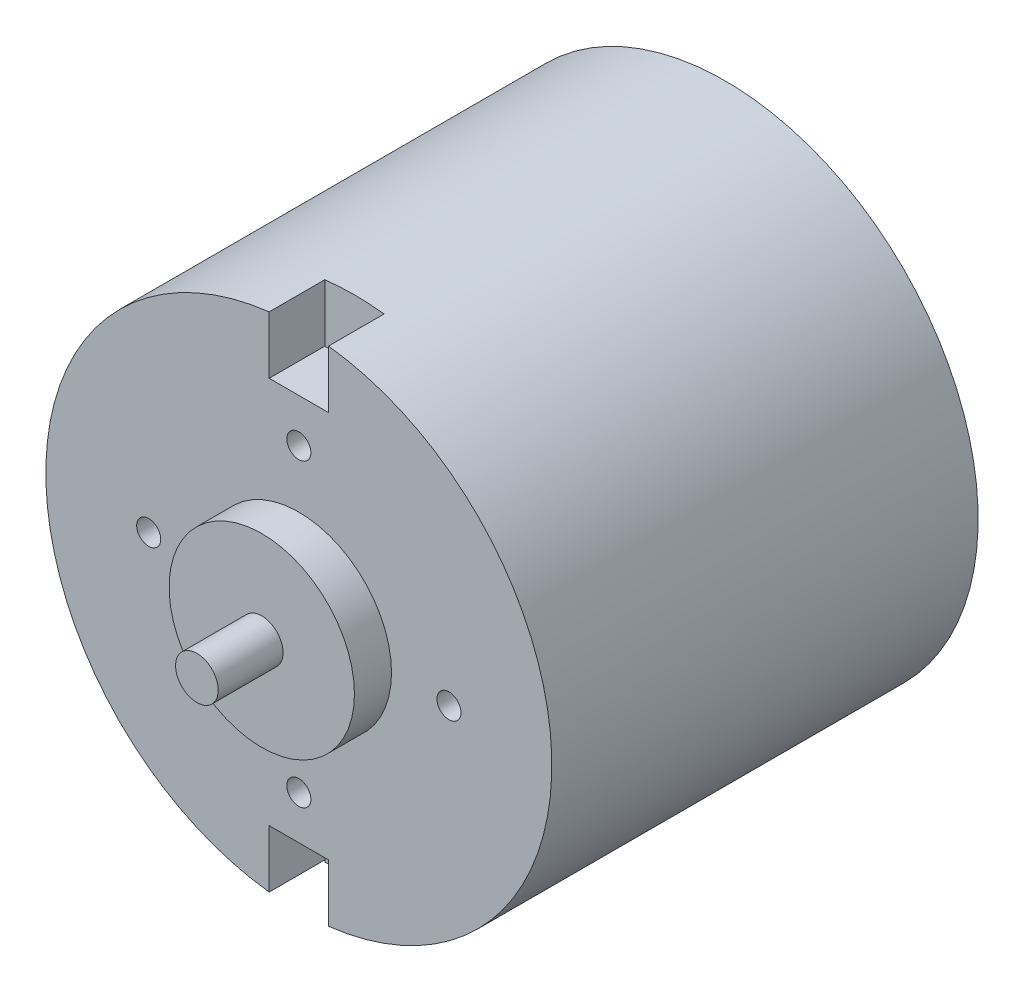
ISO-10303-21;
HEADER;
FILE_DESCRIPTION(('STEP AP214'),'2;1');
FILE_NAME('part.step','',(''),(''),'','','');
FILE_SCHEMA(('AUTOMOTIVE_DESIGN { 1 0 10303 214 1 1 1 1 }'));
ENDSEC;
DATA;
#1=APPLICATION_CONTEXT('core data for automotive mechanical design processes');
#2=APPLICATION_PROTOCOL_DEFINITION('international standard','automotive_design',2000,#1);
#3=PRODUCT_CONTEXT('',#1,'mechanical');
#4=PRODUCT('Part','Part','',(#3));
#5=PRODUCT_RELATED_PRODUCT_CATEGORY('part','',(#4));
#6=PRODUCT_DEFINITION_FORMATION('','',#4);
#7=PRODUCT_DEFINITION_CONTEXT('part definition',#1,'design');
#8=PRODUCT_DEFINITION('design','',#6,#7);
#9=PRODUCT_DEFINITION_SHAPE('','',#8);
#10=(LENGTH_UNIT() NAMED_UNIT(*) SI_UNIT(.MILLI.,.METRE.));
#11=(NAMED_UNIT(*) PLANE_ANGLE_UNIT() SI_UNIT($,.RADIAN.));
#12=(NAMED_UNIT(*) SI_UNIT($,.STERADIAN.) SOLID_ANGLE_UNIT());
#13=UNCERTAINTY_MEASURE_WITH_UNIT(LENGTH_MEASURE(1.E-05),#10,'distance_accuracy_value','');
#14=(GEOMETRIC_REPRESENTATION_CONTEXT(3) GLOBAL_UNCERTAINTY_ASSIGNED_CONTEXT((#13)) GLOBAL_UNIT_ASSIGNED_CONTEXT((#10,
#11,#12)) REPRESENTATION_CONTEXT('',''));
#15=CARTESIAN_POINT('',(0.,0.,0.));
#16=DIRECTION('',(0.,0.,1.));
#17=DIRECTION('',(1.,0.,0.));
#18=AXIS2_PLACEMENT_3D('',#15,#16,#17);
#19=CARTESIAN_POINT('',(-1.6,0.,3.));
#20=DIRECTION('',(1.,0.,0.));
#21=DIRECTION('',(0.,1.,0.));
#22=AXIS2_PLACEMENT_3D('',#19,#20,#21);
#23=PLANE('',#22);
#24=DIRECTION('',(0.,-1.,0.));
#25=VECTOR('',#24,1.);
#26=CARTESIAN_POINT('',(-1.6,0.,0.));
#27=LINE('',#26,#25);
#28=CARTESIAN_POINT('',(-1.6,13.5559027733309,0.));
#29=VERTEX_POINT('',#28);
#30=CARTESIAN_POINT('',(-1.6,10.45,0.));
#31=VERTEX_POINT('',#30);
#32=EDGE_CURVE('E293',#29,#31,#27,.T.);
#33=ORIENTED_EDGE('',*,*,#32,.F.);
#34=DIRECTION('',(0.,0.,-1.));
#35=VECTOR('',#34,1.);
#36=CARTESIAN_POINT('',(-1.6,13.5559027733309,3.));
#37=LINE('',#36,#35);
#38=CARTESIAN_POINT('',(-1.6,13.5559027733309,3.));
#39=VERTEX_POINT('',#38);
#40=EDGE_CURVE('E12',#39,#29,#37,.T.);
#41=ORIENTED_EDGE('',*,*,#40,.F.);
#42=DIRECTION('',(0.,-1.,0.));
#43=VECTOR('',#42,1.);
#44=CARTESIAN_POINT('',(-1.6,0.,3.));
#45=LINE('',#44,#43);
#46=CARTESIAN_POINT('',(-1.6,10.45,3.));
#47=VERTEX_POINT('',#46);
#48=EDGE_CURVE('E253',#39,#47,#45,.T.);
#49=ORIENTED_EDGE('',*,*,#48,.T.);
#50=DIRECTION('',(0.,0.,-1.));
#51=VECTOR('',#50,1.);
#52=CARTESIAN_POINT('',(-1.6,10.45,3.));
#53=LINE('',#52,#51);
#54=EDGE_CURVE('E111',#47,#31,#53,.T.);
#55=ORIENTED_EDGE('',*,*,#54,.T.);
#56=EDGE_LOOP('',(#33,#41,#49,#55));
#57=FACE_BOUND('',#56,.T.);
#58=ADVANCED_FACE('F93',(#57),#23,.T.);
#59=CARTESIAN_POINT('',(-1.6,0.,3.));
#60=DIRECTION('',(-1.,0.,0.));
#61=DIRECTION('',(0.,-1.,0.));
#62=AXIS2_PLACEMENT_3D('',#59,#60,#61);
#63=PLANE('',#62);
#64=DIRECTION('',(0.,1.,0.));
#65=VECTOR('',#64,1.);
#66=CARTESIAN_POINT('',(-1.6,0.,0.));
#67=LINE('',#66,#65);
#68=CARTESIAN_POINT('',(-1.6,-13.5559027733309,0.));
#69=VERTEX_POINT('',#68);
#70=CARTESIAN_POINT('',(-1.6,-10.45,0.));
#71=VERTEX_POINT('',#70);
#72=EDGE_CURVE('E296',#69,#71,#67,.T.);
#73=ORIENTED_EDGE('',*,*,#72,.T.);
#74=DIRECTION('',(0.,0.,-1.));
#75=VECTOR('',#74,1.);
#76=CARTESIAN_POINT('',(-1.6,-10.45,3.));
#77=LINE('',#76,#75);
#78=CARTESIAN_POINT('',(-1.6,-10.45,3.));
#79=VERTEX_POINT('',#78);
#80=EDGE_CURVE('E329',#79,#71,#77,.T.);
#81=ORIENTED_EDGE('',*,*,#80,.F.);
#82=DIRECTION('',(0.,1.,0.));
#83=VECTOR('',#82,1.);
#84=CARTESIAN_POINT('',(-1.6,0.,3.));
#85=LINE('',#84,#83);
#86=CARTESIAN_POINT('',(-1.6,-13.5559027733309,3.));
#87=VERTEX_POINT('',#86);
#88=EDGE_CURVE('E260',#87,#79,#85,.T.);
#89=ORIENTED_EDGE('',*,*,#88,.F.);
#90=DIRECTION('',(0.,0.,-1.));
#91=VECTOR('',#90,1.);
#92=CARTESIAN_POINT('',(-1.6,-13.5559027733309,3.));
#93=LINE('',#92,#91);
#94=EDGE_CURVE('E104',#87,#69,#93,.T.);
#95=ORIENTED_EDGE('',*,*,#94,.T.);
#96=EDGE_LOOP('',(#73,#81,#89,#95));
#97=FACE_BOUND('',#96,.T.);
#98=ADVANCED_FACE('F337',(#97),#63,.F.);
#99=CARTESIAN_POINT('',(0.,-10.45,3.));
#100=DIRECTION('',(0.,1.,0.));
#101=DIRECTION('',(-1.,0.,0.));
#102=AXIS2_PLACEMENT_3D('',#99,#100,#101);
#103=PLANE('',#102);
#104=DIRECTION('',(1.,0.,0.));
#105=VECTOR('',#104,1.);
#106=CARTESIAN_POINT('',(0.,-10.45,0.));
#107=LINE('',#106,#105);
#108=CARTESIAN_POINT('',(1.6,-10.45,0.));
#109=VERTEX_POINT('',#108);
#110=EDGE_CURVE('E300',#71,#109,#107,.T.);
#111=ORIENTED_EDGE('',*,*,#110,.T.);
#112=DIRECTION('',(0.,0.,-1.));
#113=VECTOR('',#112,1.);
#114=CARTESIAN_POINT('',(1.6,-10.45,3.));
#115=LINE('',#114,#113);
#116=CARTESIAN_POINT('',(1.6,-10.45,3.));
#117=VERTEX_POINT('',#116);
#118=EDGE_CURVE('E325',#117,#109,#115,.T.);
#119=ORIENTED_EDGE('',*,*,#118,.F.);
#120=DIRECTION('',(1.,0.,0.));
#121=VECTOR('',#120,1.);
#122=CARTESIAN_POINT('',(0.,-10.45,3.));
#123=LINE('',#122,#121);
#124=EDGE_CURVE('E265',#79,#117,#123,.T.);
#125=ORIENTED_EDGE('',*,*,#124,.F.);
#126=ORIENTED_EDGE('',*,*,#80,.T.);
#127=EDGE_LOOP('',(#111,#119,#125,#126));
#128=FACE_BOUND('',#127,.T.);
#129=ADVANCED_FACE('F355',(#128),#103,.F.);
#130=CARTESIAN_POINT('',(1.6,0.,3.));
#131=DIRECTION('',(-1.,0.,0.));
#132=DIRECTION('',(0.,-1.,0.));
#133=AXIS2_PLACEMENT_3D('',#130,#131,#132);
#134=PLANE('',#133);
#135=DIRECTION('',(0.,1.,0.));
#136=VECTOR('',#135,1.);
#137=CARTESIAN_POINT('',(1.6,0.,0.));
#138=LINE('',#137,#136);
#139=CARTESIAN_POINT('',(1.6,-13.5559027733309,0.));
#140=VERTEX_POINT('',#139);
#141=EDGE_CURVE('E304',#140,#109,#138,.T.);
#142=ORIENTED_EDGE('',*,*,#141,.F.);
#143=DIRECTION('',(0.,0.,-1.));
#144=VECTOR('',#143,1.);
#145=CARTESIAN_POINT('',(1.6,-13.5559027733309,3.));
#146=LINE('',#145,#144);
#147=CARTESIAN_POINT('',(1.6,-13.5559027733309,3.));
#148=VERTEX_POINT('',#147);
#149=EDGE_CURVE('E182',#148,#140,#146,.T.);
#150=ORIENTED_EDGE('',*,*,#149,.F.);
#151=DIRECTION('',(0.,1.,0.));
#152=VECTOR('',#151,1.);
#153=CARTESIAN_POINT('',(1.6,0.,3.));
#154=LINE('',#153,#152);
#155=EDGE_CURVE('E268',#148,#117,#154,.T.);
#156=ORIENTED_EDGE('',*,*,#155,.T.);
#157=ORIENTED_EDGE('',*,*,#118,.T.);
#158=EDGE_LOOP('',(#142,#150,#156,#157));
#159=FACE_BOUND('',#158,.T.);
#160=ADVANCED_FACE('F352',(#159),#134,.T.);
#161=CARTESIAN_POINT('',(0.,0.,3.));
#162=DIRECTION('',(0.,0.,-1.));
#163=DIRECTION('',(-1.,0.,0.));
#164=AXIS2_PLACEMENT_3D('',#161,#162,#163);
#165=CYLINDRICAL_SURFACE('',#164,13.65);
#166=ORIENTED_EDGE('',*,*,#149,.T.);
#167=DIRECTION('',(0.,0.,1.));
#168=VECTOR('',#167,1.);
#169=CARTESIAN_POINT('',(1.6,-13.5559027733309,-20.));
#170=LINE('',#169,#168);
#171=CARTESIAN_POINT('',(1.6,-13.5559027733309,-20.));
#172=VERTEX_POINT('',#171);
#173=EDGE_CURVE('E175',#172,#140,#170,.T.);
#174=ORIENTED_EDGE('',*,*,#173,.F.);
#175=CARTESIAN_POINT('',(0.,0.,-20.));
#176=DIRECTION('',(0.,0.,1.));
#177=DIRECTION('',(1.,0.,0.));
#178=AXIS2_PLACEMENT_3D('',#175,#176,#177);
#179=CIRCLE('',#178,13.65);
#180=CARTESIAN_POINT('',(-1.6,-13.5559027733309,-20.));
#181=VERTEX_POINT('',#180);
#182=EDGE_CURVE('E180',#172,#181,#179,.T.);
#183=ORIENTED_EDGE('',*,*,#182,.T.);
#184=DIRECTION('',(0.,0.,1.));
#185=VECTOR('',#184,1.);
#186=CARTESIAN_POINT('',(-1.6,-13.5559027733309,-20.));
#187=LINE('',#186,#185);
#188=EDGE_CURVE('E188',#181,#69,#187,.T.);
#189=ORIENTED_EDGE('',*,*,#188,.T.);
#190=ORIENTED_EDGE('',*,*,#94,.F.);
#191=CARTESIAN_POINT('',(0.,0.,3.));
#192=DIRECTION('',(0.,0.,1.));
#193=DIRECTION('',(1.,0.,0.));
#194=AXIS2_PLACEMENT_3D('',#191,#192,#193);
#195=CIRCLE('',#194,13.65);
#196=EDGE_CURVE('E256',#39,#87,#195,.T.);
#197=ORIENTED_EDGE('',*,*,#196,.F.);
#198=ORIENTED_EDGE('',*,*,#40,.T.);
#199=CARTESIAN_POINT('',(0.,0.,0.));
#200=DIRECTION('',(0.,0.,1.));
#201=DIRECTION('',(1.,0.,0.));
#202=AXIS2_PLACEMENT_3D('',#199,#200,#201);
#203=CIRCLE('',#202,13.65);
#204=CARTESIAN_POINT('',(1.6,13.5559027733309,0.));
#205=VERTEX_POINT('',#204);
#206=EDGE_CURVE('E205',#205,#29,#203,.T.);
#207=ORIENTED_EDGE('',*,*,#206,.F.);
#208=DIRECTION('',(0.,0.,-1.));
#209=VECTOR('',#208,1.);
#210=CARTESIAN_POINT('',(1.6,13.5559027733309,3.));
#211=LINE('',#210,#209);
#212=CARTESIAN_POINT('',(1.6,13.5559027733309,3.));
#213=VERTEX_POINT('',#212);
#214=EDGE_CURVE('E319',#213,#205,#211,.T.);
#215=ORIENTED_EDGE('',*,*,#214,.F.);
#216=EDGE_CURVE('E261',#148,#213,#195,.T.);
#217=ORIENTED_EDGE('',*,*,#216,.F.);
#218=EDGE_LOOP('',(#166,#174,#183,#189,#190,#197,#198,#207,#215,#217));
#219=FACE_BOUND('',#218,.T.);
#220=ADVANCED_FACE('F177',(#219),#165,.T.);
#221=CARTESIAN_POINT('',(1.6,0.,3.));
#222=DIRECTION('',(1.,0.,0.));
#223=DIRECTION('',(0.,1.,0.));
#224=AXIS2_PLACEMENT_3D('',#221,#222,#223);
#225=PLANE('',#224);
#226=DIRECTION('',(0.,-1.,0.));
#227=VECTOR('',#226,1.);
#228=CARTESIAN_POINT('',(1.6,0.,0.));
#229=LINE('',#228,#227);
#230=CARTESIAN_POINT('',(1.6,10.45,0.));
#231=VERTEX_POINT('',#230);
#232=EDGE_CURVE('E307',#205,#231,#229,.T.);
#233=ORIENTED_EDGE('',*,*,#232,.T.);
#234=DIRECTION('',(0.,0.,-1.));
#235=VECTOR('',#234,1.);
#236=CARTESIAN_POINT('',(1.6,10.45,3.));
#237=LINE('',#236,#235);
#238=CARTESIAN_POINT('',(1.6,10.45,3.));
#239=VERTEX_POINT('',#238);
#240=EDGE_CURVE('E315',#239,#231,#237,.T.);
#241=ORIENTED_EDGE('',*,*,#240,.F.);
#242=DIRECTION('',(0.,-1.,0.));
#243=VECTOR('',#242,1.);
#244=CARTESIAN_POINT('',(1.6,0.,3.));
#245=LINE('',#244,#243);
#246=EDGE_CURVE('E272',#213,#239,#245,.T.);
#247=ORIENTED_EDGE('',*,*,#246,.F.);
#248=ORIENTED_EDGE('',*,*,#214,.T.);
#249=EDGE_LOOP('',(#233,#241,#247,#248));
#250=FACE_BOUND('',#249,.T.);
#251=ADVANCED_FACE('F365',(#250),#225,.F.);
#252=CARTESIAN_POINT('',(0.,8.1,3.));
#253=DIRECTION('',(0.,0.,-1.));
#254=DIRECTION('',(-1.,0.,0.));
#255=AXIS2_PLACEMENT_3D('',#252,#253,#254);
#256=CYLINDRICAL_SURFACE('',#255,0.65);
#257=CARTESIAN_POINT('',(0.,8.1,3.));
#258=DIRECTION('',(0.,0.,1.));
#259=DIRECTION('',(1.,0.,0.));
#260=AXIS2_PLACEMENT_3D('',#257,#258,#259);
#261=CIRCLE('',#260,0.65);
#262=CARTESIAN_POINT('',(0.65,8.1,3.));
#263=VERTEX_POINT('',#262);
#264=EDGE_CURVE('E249',#263,#263,#261,.T.);
#265=ORIENTED_EDGE('',*,*,#264,.T.);
#266=EDGE_LOOP('',(#265));
#267=FACE_BOUND('',#266,.T.);
#268=CARTESIAN_POINT('',(0.,8.1,0.));
#269=DIRECTION('',(0.,0.,1.));
#270=DIRECTION('',(1.,0.,0.));
#271=AXIS2_PLACEMENT_3D('',#268,#269,#270);
#272=CIRCLE('',#271,0.65);
#273=CARTESIAN_POINT('',(0.65,8.1,0.));
#274=VERTEX_POINT('',#273);
#275=EDGE_CURVE('E289',#274,#274,#272,.T.);
#276=ORIENTED_EDGE('',*,*,#275,.F.);
#277=EDGE_LOOP('',(#276));
#278=FACE_BOUND('',#277,.T.);
#279=ADVANCED_FACE('F389',(#267,#278),#256,.F.);
#280=CARTESIAN_POINT('',(0.,-8.1,3.));
#281=DIRECTION('',(0.,0.,-1.));
#282=DIRECTION('',(-1.,0.,0.));
#283=AXIS2_PLACEMENT_3D('',#280,#281,#282);
#284=CYLINDRICAL_SURFACE('',#283,0.65);
#285=CARTESIAN_POINT('',(0.,-8.1,3.));
#286=DIRECTION('',(0.,0.,1.));
#287=DIRECTION('',(1.,0.,0.));
#288=AXIS2_PLACEMENT_3D('',#285,#286,#287);
#289=CIRCLE('',#288,0.65);
#290=CARTESIAN_POINT('',(0.65,-8.1,3.));
#291=VERTEX_POINT('',#290);
#292=EDGE_CURVE('E245',#291,#291,#289,.T.);
#293=ORIENTED_EDGE('',*,*,#292,.T.);
#294=EDGE_LOOP('',(#293));
#295=FACE_BOUND('',#294,.T.);
#296=CARTESIAN_POINT('',(0.,-8.1,0.));
#297=DIRECTION('',(0.,0.,1.));
#298=DIRECTION('',(1.,0.,0.));
#299=AXIS2_PLACEMENT_3D('',#296,#297,#298);
#300=CIRCLE('',#299,0.65);
#301=CARTESIAN_POINT('',(0.65,-8.1,0.));
#302=VERTEX_POINT('',#301);
#303=EDGE_CURVE('E285',#302,#302,#300,.T.);
#304=ORIENTED_EDGE('',*,*,#303,.F.);
#305=EDGE_LOOP('',(#304));
#306=FACE_BOUND('',#305,.T.);
#307=ADVANCED_FACE('F392',(#295,#306),#284,.F.);
#308=CARTESIAN_POINT('',(-8.1,0.,3.));
#309=DIRECTION('',(0.,0.,-1.));
#310=DIRECTION('',(-1.,0.,0.));
#311=AXIS2_PLACEMENT_3D('',#308,#309,#310);
#312=CYLINDRICAL_SURFACE('',#311,0.65);
#313=CARTESIAN_POINT('',(-8.1,0.,3.));
#314=DIRECTION('',(0.,0.,1.));
#315=DIRECTION('',(1.,0.,0.));
#316=AXIS2_PLACEMENT_3D('',#313,#314,#315);
#317=CIRCLE('',#316,0.65);
#318=CARTESIAN_POINT('',(-7.45,0.,3.));
#319=VERTEX_POINT('',#318);
#320=EDGE_CURVE('E240',#319,#319,#317,.T.);
#321=ORIENTED_EDGE('',*,*,#320,.T.);
#322=EDGE_LOOP('',(#321));
#323=FACE_BOUND('',#322,.T.);
#324=CARTESIAN_POINT('',(-8.1,0.,0.));
#325=DIRECTION('',(0.,0.,1.));
#326=DIRECTION('',(1.,0.,0.));
#327=AXIS2_PLACEMENT_3D('',#324,#325,#326);
#328=CIRCLE('',#327,0.65);
#329=CARTESIAN_POINT('',(-7.45,0.,0.));
#330=VERTEX_POINT('',#329);
#331=EDGE_CURVE('E281',#330,#330,#328,.T.);
#332=ORIENTED_EDGE('',*,*,#331,.F.);
#333=EDGE_LOOP('',(#332));
#334=FACE_BOUND('',#333,.T.);
#335=ADVANCED_FACE('F378',(#323,#334),#312,.F.);
#336=CARTESIAN_POINT('',(8.1,0.,3.));
#337=DIRECTION('',(0.,0.,-1.));
#338=DIRECTION('',(-1.,0.,0.));
#339=AXIS2_PLACEMENT_3D('',#336,#337,#338);
#340=CYLINDRICAL_SURFACE('',#339,0.649999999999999);
#341=CARTESIAN_POINT('',(8.1,0.,3.));
#342=DIRECTION('',(0.,0.,1.));
#343=DIRECTION('',(1.,0.,0.));
#344=AXIS2_PLACEMENT_3D('',#341,#342,#343);
#345=CIRCLE('',#344,0.649999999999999);
#346=CARTESIAN_POINT('',(8.75,0.,3.));
#347=VERTEX_POINT('',#346);
#348=EDGE_CURVE('E236',#347,#347,#345,.T.);
#349=ORIENTED_EDGE('',*,*,#348,.T.);
#350=EDGE_LOOP('',(#349));
#351=FACE_BOUND('',#350,.T.);
#352=CARTESIAN_POINT('',(8.1,0.,0.));
#353=DIRECTION('',(0.,0.,1.));
#354=DIRECTION('',(1.,0.,0.));
#355=AXIS2_PLACEMENT_3D('',#352,#353,#354);
#356=CIRCLE('',#355,0.649999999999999);
#357=CARTESIAN_POINT('',(8.75,0.,0.));
#358=VERTEX_POINT('',#357);
#359=EDGE_CURVE('E215',#358,#358,#356,.T.);
#360=ORIENTED_EDGE('',*,*,#359,.F.);
#361=EDGE_LOOP('',(#360));
#362=FACE_BOUND('',#361,.T.);
#363=ADVANCED_FACE('F95',(#351,#362),#340,.F.);
#364=CARTESIAN_POINT('',(0.,10.45,3.));
#365=DIRECTION('',(0.,1.,0.));
#366=DIRECTION('',(0.,0.,1.));
#367=AXIS2_PLACEMENT_3D('',#364,#365,#366);
#368=PLANE('',#367);
#369=DIRECTION('',(1.,0.,0.));
#370=VECTOR('',#369,1.);
#371=CARTESIAN_POINT('',(0.,10.45,0.));
#372=LINE('',#371,#370);
#373=EDGE_CURVE('E241',#31,#231,#372,.T.);
#374=ORIENTED_EDGE('',*,*,#373,.F.);
#375=ORIENTED_EDGE('',*,*,#54,.F.);
#376=DIRECTION('',(1.,0.,0.));
#377=VECTOR('',#376,1.);
#378=CARTESIAN_POINT('',(0.,10.45,3.));
#379=LINE('',#378,#377);
#380=EDGE_CURVE('E275',#47,#239,#379,.T.);
#381=ORIENTED_EDGE('',*,*,#380,.T.);
#382=ORIENTED_EDGE('',*,*,#240,.T.);
#383=EDGE_LOOP('',(#374,#375,#381,#382));
#384=FACE_BOUND('',#383,.T.);
#385=ADVANCED_FACE('F369',(#384),#368,.T.);
#386=CARTESIAN_POINT('',(0.,0.,3.));
#387=DIRECTION('',(0.,0.,1.));
#388=DIRECTION('',(1.,0.,0.));
#389=AXIS2_PLACEMENT_3D('',#386,#387,#388);
#390=PLANE('',#389);
#391=CARTESIAN_POINT('',(0.,0.,3.));
#392=DIRECTION('',(0.,0.,1.));
#393=DIRECTION('',(1.,0.,0.));
#394=AXIS2_PLACEMENT_3D('',#391,#392,#393);
#395=CIRCLE('',#394,5.);
#396=CARTESIAN_POINT('',(5.,0.,3.));
#397=VERTEX_POINT('',#396);
#398=EDGE_CURVE('E97',#397,#397,#395,.F.);
#399=ORIENTED_EDGE('',*,*,#398,.T.);
#400=EDGE_LOOP('',(#399));
#401=FACE_BOUND('',#400,.T.);
#402=ORIENTED_EDGE('',*,*,#348,.F.);
#403=EDGE_LOOP('',(#402));
#404=FACE_BOUND('',#403,.T.);
#405=ORIENTED_EDGE('',*,*,#320,.F.);
#406=EDGE_LOOP('',(#405));
#407=FACE_BOUND('',#406,.T.);
#408=ORIENTED_EDGE('',*,*,#292,.F.);
#409=EDGE_LOOP('',(#408));
#410=FACE_BOUND('',#409,.T.);
#411=ORIENTED_EDGE('',*,*,#264,.F.);
#412=EDGE_LOOP('',(#411));
#413=FACE_BOUND('',#412,.T.);
#414=ORIENTED_EDGE('',*,*,#48,.F.);
#415=ORIENTED_EDGE('',*,*,#196,.T.);
#416=ORIENTED_EDGE('',*,*,#88,.T.);
#417=ORIENTED_EDGE('',*,*,#124,.T.);
#418=ORIENTED_EDGE('',*,*,#155,.F.);
#419=ORIENTED_EDGE('',*,*,#216,.T.);
#420=ORIENTED_EDGE('',*,*,#246,.T.);
#421=ORIENTED_EDGE('',*,*,#380,.F.);
#422=EDGE_LOOP('',(#414,#415,#416,#417,#418,#419,#420,#421));
#423=FACE_BOUND('',#422,.T.);
#424=ADVANCED_FACE('F357',(#401,#404,#407,#410,#413,#423),#390,.T.);
#425=CARTESIAN_POINT('',(-1.6,-13.65,-20.));
#426=DIRECTION('',(0.,-1.,0.));
#427=DIRECTION('',(0.,0.,-1.));
#428=AXIS2_PLACEMENT_3D('',#425,#426,#427);
#429=PLANE('',#428);
#430=DIRECTION('',(1.,0.,0.));
#431=VECTOR('',#430,1.);
#432=CARTESIAN_POINT('',(-1.6,-13.65,0.));
#433=LINE('',#432,#431);
#434=CARTESIAN_POINT('',(-1.6,-13.65,0.));
#435=VERTEX_POINT('',#434);
#436=CARTESIAN_POINT('',(1.6,-13.65,0.));
#437=VERTEX_POINT('',#436);
#438=EDGE_CURVE('E222',#435,#437,#433,.T.);
#439=ORIENTED_EDGE('',*,*,#438,.F.);
#440=DIRECTION('',(0.,0.,1.));
#441=VECTOR('',#440,1.);
#442=CARTESIAN_POINT('',(-1.6,-13.65,-20.));
#443=LINE('',#442,#441);
#444=CARTESIAN_POINT('',(-1.6,-13.65,-20.));
#445=VERTEX_POINT('',#444);
#446=EDGE_CURVE('E208',#445,#435,#443,.T.);
#447=ORIENTED_EDGE('',*,*,#446,.F.);
#448=DIRECTION('',(1.,0.,0.));
#449=VECTOR('',#448,1.);
#450=CARTESIAN_POINT('',(-1.6,-13.65,-20.));
#451=LINE('',#450,#449);
#452=CARTESIAN_POINT('',(1.6,-13.65,-20.));
#453=VERTEX_POINT('',#452);
#454=EDGE_CURVE('E199',#445,#453,#451,.T.);
#455=ORIENTED_EDGE('',*,*,#454,.T.);
#456=DIRECTION('',(0.,0.,1.));
#457=VECTOR('',#456,1.);
#458=CARTESIAN_POINT('',(1.6,-13.65,-20.));
#459=LINE('',#458,#457);
#460=EDGE_CURVE('E193',#453,#437,#459,.T.);
#461=ORIENTED_EDGE('',*,*,#460,.T.);
#462=EDGE_LOOP('',(#439,#447,#455,#461));
#463=FACE_BOUND('',#462,.T.);
#464=ADVANCED_FACE('F349',(#463),#429,.T.);
#465=CARTESIAN_POINT('',(1.6,-13.65,-20.));
#466=DIRECTION('',(1.,0.,0.));
#467=DIRECTION('',(0.,1.,0.));
#468=AXIS2_PLACEMENT_3D('',#465,#466,#467);
#469=PLANE('',#468);
#470=DIRECTION('',(0.,1.,0.));
#471=VECTOR('',#470,1.);
#472=CARTESIAN_POINT('',(1.6,-13.65,-20.));
#473=LINE('',#472,#471);
#474=EDGE_CURVE('E191',#453,#172,#473,.T.);
#475=ORIENTED_EDGE('',*,*,#474,.T.);
#476=ORIENTED_EDGE('',*,*,#173,.T.);
#477=DIRECTION('',(0.,1.,0.));
#478=VECTOR('',#477,1.);
#479=CARTESIAN_POINT('',(1.6,-13.65,0.));
#480=LINE('',#479,#478);
#481=EDGE_CURVE('E226',#437,#140,#480,.T.);
#482=ORIENTED_EDGE('',*,*,#481,.F.);
#483=ORIENTED_EDGE('',*,*,#460,.F.);
#484=EDGE_LOOP('',(#475,#476,#482,#483));
#485=FACE_BOUND('',#484,.T.);
#486=ADVANCED_FACE('F192',(#485),#469,.T.);
#487=CARTESIAN_POINT('',(-1.6,-13.65,-20.));
#488=DIRECTION('',(1.,0.,0.));
#489=DIRECTION('',(0.,1.,0.));
#490=AXIS2_PLACEMENT_3D('',#487,#488,#489);
#491=PLANE('',#490);
#492=ORIENTED_EDGE('',*,*,#188,.F.);
#493=DIRECTION('',(0.,1.,0.));
#494=VECTOR('',#493,1.);
#495=CARTESIAN_POINT('',(-1.6,-13.65,-20.));
#496=LINE('',#495,#494);
#497=EDGE_CURVE('E198',#445,#181,#496,.T.);
#498=ORIENTED_EDGE('',*,*,#497,.F.);
#499=ORIENTED_EDGE('',*,*,#446,.T.);
#500=DIRECTION('',(0.,1.,0.));
#501=VECTOR('',#500,1.);
#502=CARTESIAN_POINT('',(-1.6,-13.65,0.));
#503=LINE('',#502,#501);
#504=EDGE_CURVE('E218',#435,#69,#503,.T.);
#505=ORIENTED_EDGE('',*,*,#504,.T.);
#506=EDGE_LOOP('',(#492,#498,#499,#505));
#507=FACE_BOUND('',#506,.T.);
#508=ADVANCED_FACE('F343',(#507),#491,.F.);
#509=CARTESIAN_POINT('',(0.,0.,-20.));
#510=DIRECTION('',(0.,0.,1.));
#511=DIRECTION('',(1.,0.,0.));
#512=AXIS2_PLACEMENT_3D('',#509,#510,#511);
#513=PLANE('',#512);
#514=ORIENTED_EDGE('',*,*,#182,.F.);
#515=ORIENTED_EDGE('',*,*,#474,.F.);
#516=ORIENTED_EDGE('',*,*,#454,.F.);
#517=ORIENTED_EDGE('',*,*,#497,.T.);
#518=EDGE_LOOP('',(#514,#515,#516,#517));
#519=FACE_BOUND('',#518,.T.);
#520=ADVANCED_FACE('F202',(#519),#513,.F.);
#521=CARTESIAN_POINT('',(0.,0.,0.));
#522=DIRECTION('',(0.,0.,1.));
#523=DIRECTION('',(1.,0.,0.));
#524=AXIS2_PLACEMENT_3D('',#521,#522,#523);
#525=PLANE('',#524);
#526=ORIENTED_EDGE('',*,*,#481,.T.);
#527=ORIENTED_EDGE('',*,*,#141,.T.);
#528=ORIENTED_EDGE('',*,*,#110,.F.);
#529=ORIENTED_EDGE('',*,*,#72,.F.);
#530=ORIENTED_EDGE('',*,*,#504,.F.);
#531=ORIENTED_EDGE('',*,*,#438,.T.);
#532=EDGE_LOOP('',(#526,#527,#528,#529,#530,#531));
#533=FACE_BOUND('',#532,.T.);
#534=ADVANCED_FACE('F346',(#533),#525,.T.);
#535=ORIENTED_EDGE('',*,*,#206,.T.);
#536=ORIENTED_EDGE('',*,*,#32,.T.);
#537=ORIENTED_EDGE('',*,*,#373,.T.);
#538=ORIENTED_EDGE('',*,*,#232,.F.);
#539=EDGE_LOOP('',(#535,#536,#537,#538));
#540=FACE_BOUND('',#539,.T.);
#541=ADVANCED_FACE('F420',(#540),#525,.T.);
#542=ORIENTED_EDGE('',*,*,#275,.T.);
#543=EDGE_LOOP('',(#542));
#544=FACE_BOUND('',#543,.T.);
#545=ADVANCED_FACE('F415',(#544),#525,.T.);
#546=ORIENTED_EDGE('',*,*,#303,.T.);
#547=EDGE_LOOP('',(#546));
#548=FACE_BOUND('',#547,.T.);
#549=ADVANCED_FACE('F407',(#548),#525,.T.);
#550=ORIENTED_EDGE('',*,*,#331,.T.);
#551=EDGE_LOOP('',(#550));
#552=FACE_BOUND('',#551,.T.);
#553=ADVANCED_FACE('F404',(#552),#525,.T.);
#554=ORIENTED_EDGE('',*,*,#359,.T.);
#555=EDGE_LOOP('',(#554));
#556=FACE_BOUND('',#555,.T.);
#557=ADVANCED_FACE('F406',(#556),#525,.T.);
#558=CARTESIAN_POINT('',(0.,0.,5.));
#559=DIRECTION('',(0.,0.,-1.));
#560=DIRECTION('',(-1.,0.,0.));
#561=AXIS2_PLACEMENT_3D('',#558,#559,#560);
#562=CYLINDRICAL_SURFACE('',#561,5.);
#563=ORIENTED_EDGE('',*,*,#398,.F.);
#564=EDGE_LOOP('',(#563));
#565=FACE_BOUND('',#564,.T.);
#566=CARTESIAN_POINT('',(0.,0.,5.));
#567=DIRECTION('',(0.,0.,1.));
#568=DIRECTION('',(1.,0.,0.));
#569=AXIS2_PLACEMENT_3D('',#566,#567,#568);
#570=CIRCLE('',#569,5.);
#571=CARTESIAN_POINT('',(5.,0.,5.));
#572=VERTEX_POINT('',#571);
#573=EDGE_CURVE('E211',#572,#572,#570,.T.);
#574=ORIENTED_EDGE('',*,*,#573,.F.);
#575=EDGE_LOOP('',(#574));
#576=FACE_BOUND('',#575,.T.);
#577=ADVANCED_FACE('F413',(#565,#576),#562,.T.);
#578=CARTESIAN_POINT('',(0.,0.,5.));
#579=DIRECTION('',(0.,0.,1.));
#580=DIRECTION('',(1.,0.,0.));
#581=AXIS2_PLACEMENT_3D('',#578,#579,#580);
#582=PLANE('',#581);
#583=CARTESIAN_POINT('',(0.,0.,5.));
#584=DIRECTION('',(0.,0.,1.));
#585=DIRECTION('',(1.,0.,0.));
#586=AXIS2_PLACEMENT_3D('',#583,#584,#585);
#587=CIRCLE('',#586,1.15);
#588=CARTESIAN_POINT('',(1.15,0.,5.));
#589=VERTEX_POINT('',#588);
#590=EDGE_CURVE('E531',#589,#589,#587,.T.);
#591=ORIENTED_EDGE('',*,*,#590,.F.);
#592=EDGE_LOOP('',(#591));
#593=FACE_BOUND('',#592,.T.);
#594=ORIENTED_EDGE('',*,*,#573,.T.);
#595=EDGE_LOOP('',(#594));
#596=FACE_BOUND('',#595,.T.);
#597=ADVANCED_FACE('F493',(#593,#596),#582,.T.);
#598=CARTESIAN_POINT('',(0.,0.,8.5));
#599=DIRECTION('',(0.,0.,-1.));
#600=DIRECTION('',(-1.,0.,0.));
#601=AXIS2_PLACEMENT_3D('',#598,#599,#600);
#602=CYLINDRICAL_SURFACE('',#601,1.15);
#603=ORIENTED_EDGE('',*,*,#590,.T.);
#604=EDGE_LOOP('',(#603));
#605=FACE_BOUND('',#604,.T.);
#606=CARTESIAN_POINT('',(0.,0.,8.5));
#607=DIRECTION('',(0.,0.,1.));
#608=DIRECTION('',(1.,0.,0.));
#609=AXIS2_PLACEMENT_3D('',#606,#607,#608);
#610=CIRCLE('',#609,1.15);
#611=CARTESIAN_POINT('',(1.15,0.,8.5));
#612=VERTEX_POINT('',#611);
#613=EDGE_CURVE('E528',#612,#612,#610,.T.);
#614=ORIENTED_EDGE('',*,*,#613,.F.);
#615=EDGE_LOOP('',(#614));
#616=FACE_BOUND('',#615,.T.);
#617=ADVANCED_FACE('F502',(#605,#616),#602,.T.);
#618=CARTESIAN_POINT('',(0.,0.,8.5));
#619=DIRECTION('',(0.,0.,1.));
#620=DIRECTION('',(1.,0.,0.));
#621=AXIS2_PLACEMENT_3D('',#618,#619,#620);
#622=PLANE('',#621);
#623=ORIENTED_EDGE('',*,*,#613,.T.);
#624=EDGE_LOOP('',(#623));
#625=FACE_BOUND('',#624,.T.);
#626=ADVANCED_FACE('F512',(#625),#622,.T.);
#627=CLOSED_SHELL('',(#58,#98,#129,#160,#220,#251,#279,#307,#335,#363,#385,#424,#464,#486,#508,
#520,#534,#541,#545,#549,#553,#557,#577,#597,#617,#626));
#628=MANIFOLD_SOLID_BREP('B2',#627);
#629=ADVANCED_BREP_SHAPE_REPRESENTATION('',(#18,#628),#14);
#630=SHAPE_DEFINITION_REPRESENTATION(#9,#629);
ENDSEC;
END-ISO-10303-21;
